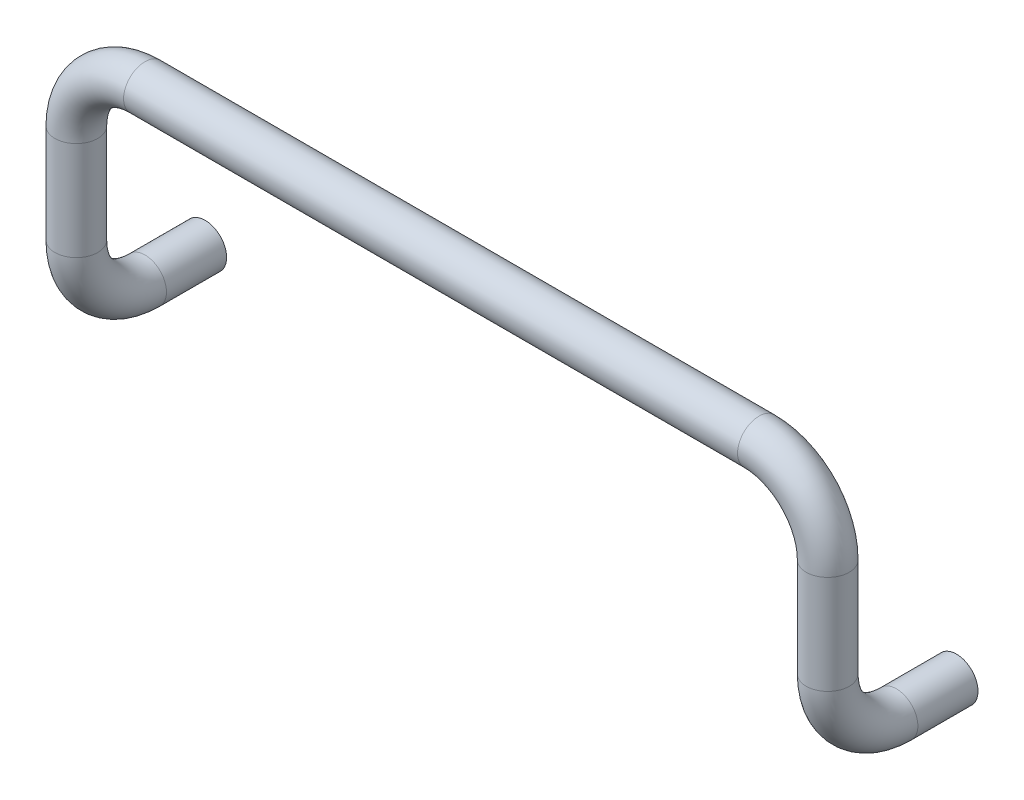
ISO-10303-21;
HEADER;
FILE_DESCRIPTION(('STEP AP214'),'2;1');
FILE_NAME('part.step','',(''),(''),'','','');
FILE_SCHEMA(('AUTOMOTIVE_DESIGN { 1 0 10303 214 1 1 1 1 }'));
ENDSEC;
DATA;
#1=APPLICATION_CONTEXT('core data for automotive mechanical design processes');
#2=APPLICATION_PROTOCOL_DEFINITION('international standard','automotive_design',2000,#1);
#3=PRODUCT_CONTEXT('',#1,'mechanical');
#4=PRODUCT('Part','Part','',(#3));
#5=PRODUCT_RELATED_PRODUCT_CATEGORY('part','',(#4));
#6=PRODUCT_DEFINITION_FORMATION('','',#4);
#7=PRODUCT_DEFINITION_CONTEXT('part definition',#1,'design');
#8=PRODUCT_DEFINITION('design','',#6,#7);
#9=PRODUCT_DEFINITION_SHAPE('','',#8);
#10=(LENGTH_UNIT() NAMED_UNIT(*) SI_UNIT(.MILLI.,.METRE.));
#11=(NAMED_UNIT(*) PLANE_ANGLE_UNIT() SI_UNIT($,.RADIAN.));
#12=(NAMED_UNIT(*) SI_UNIT($,.STERADIAN.) SOLID_ANGLE_UNIT());
#13=UNCERTAINTY_MEASURE_WITH_UNIT(LENGTH_MEASURE(1.E-05),#10,'distance_accuracy_value','');
#14=(GEOMETRIC_REPRESENTATION_CONTEXT(3) GLOBAL_UNCERTAINTY_ASSIGNED_CONTEXT((#13)) GLOBAL_UNIT_ASSIGNED_CONTEXT((#10,
#11,#12)) REPRESENTATION_CONTEXT('',''));
#15=CARTESIAN_POINT('',(0.,0.,0.));
#16=DIRECTION('',(0.,0.,1.));
#17=DIRECTION('',(1.,0.,0.));
#18=AXIS2_PLACEMENT_3D('',#15,#16,#17);
#19=CARTESIAN_POINT('',(0.,0.,28.));
#20=DIRECTION('',(0.,0.,-1.));
#21=DIRECTION('',(-1.,0.,0.));
#22=AXIS2_PLACEMENT_3D('',#19,#20,#21);
#23=CYLINDRICAL_SURFACE('',#22,10.);
#24=CARTESIAN_POINT('',(0.,0.,28.));
#25=DIRECTION('',(0.,0.,-1.));
#26=DIRECTION('',(-1.,0.,0.));
#27=AXIS2_PLACEMENT_3D('',#24,#25,#26);
#28=CIRCLE('',#27,10.);
#29=CARTESIAN_POINT('',(0.,-10.,28.));
#30=VERTEX_POINT('',#29);
#31=EDGE_CURVE('E35',#30,#30,#28,.T.);
#32=ORIENTED_EDGE('',*,*,#31,.T.);
#33=EDGE_LOOP('',(#32));
#34=FACE_BOUND('',#33,.T.);
#35=CARTESIAN_POINT('',(0.,0.,0.));
#36=DIRECTION('',(0.,0.,-1.));
#37=DIRECTION('',(-1.,0.,0.));
#38=AXIS2_PLACEMENT_3D('',#35,#36,#37);
#39=CIRCLE('',#38,10.);
#40=CARTESIAN_POINT('',(-10.,0.,0.));
#41=VERTEX_POINT('',#40);
#42=EDGE_CURVE('E32',#41,#41,#39,.T.);
#43=ORIENTED_EDGE('',*,*,#42,.F.);
#44=EDGE_LOOP('',(#43));
#45=FACE_BOUND('',#44,.T.);
#46=ADVANCED_FACE('F12',(#34,#45),#23,.T.);
#47=CARTESIAN_POINT('',(0.,32.,28.));
#48=DIRECTION('',(1.,0.,0.));
#49=DIRECTION('',(0.,1.,0.));
#50=AXIS2_PLACEMENT_3D('',#47,#48,#49);
#51=TOROIDAL_SURFACE('',#50,32.,10.);
#52=CARTESIAN_POINT('',(0.,32.,60.));
#53=DIRECTION('',(0.,-1.,0.));
#54=DIRECTION('',(-1.,0.,0.));
#55=AXIS2_PLACEMENT_3D('',#52,#53,#54);
#56=CIRCLE('',#55,10.);
#57=CARTESIAN_POINT('',(0.,32.,70.));
#58=VERTEX_POINT('',#57);
#59=EDGE_CURVE('E38',#58,#58,#56,.T.);
#60=CARTESIAN_POINT('',(0.,32.,28.));
#61=DIRECTION('',(1.,0.,0.));
#62=DIRECTION('',(0.,1.,0.));
#63=AXIS2_PLACEMENT_3D('',#60,#61,#62);
#64=CIRCLE('',#63,42.);
#65=EDGE_CURVE('',#58,#30,#64,.T.);
#66=ORIENTED_EDGE('',*,*,#59,.T.);
#67=ORIENTED_EDGE('',*,*,#31,.F.);
#68=ORIENTED_EDGE('',*,*,#65,.T.);
#69=ORIENTED_EDGE('',*,*,#65,.F.);
#70=EDGE_LOOP('',(#66,#68,#67,#69));
#71=FACE_BOUND('',#70,.T.);
#72=ADVANCED_FACE('F90',(#71),#51,.T.);
#73=CARTESIAN_POINT('',(0.,78.,60.));
#74=DIRECTION('',(0.,-1.,0.));
#75=DIRECTION('',(0.,0.,-1.));
#76=AXIS2_PLACEMENT_3D('',#73,#74,#75);
#77=CYLINDRICAL_SURFACE('',#76,10.);
#78=CARTESIAN_POINT('',(0.,78.,60.));
#79=DIRECTION('',(0.,-1.,0.));
#80=DIRECTION('',(-1.,0.,0.));
#81=AXIS2_PLACEMENT_3D('',#78,#79,#80);
#82=CIRCLE('',#81,10.);
#83=CARTESIAN_POINT('',(-10.,78.,60.));
#84=VERTEX_POINT('',#83);
#85=EDGE_CURVE('E41',#84,#84,#82,.T.);
#86=ORIENTED_EDGE('',*,*,#85,.T.);
#87=EDGE_LOOP('',(#86));
#88=FACE_BOUND('',#87,.T.);
#89=ORIENTED_EDGE('',*,*,#59,.F.);
#90=EDGE_LOOP('',(#89));
#91=FACE_BOUND('',#90,.T.);
#92=ADVANCED_FACE('F97',(#88,#91),#77,.T.);
#93=CARTESIAN_POINT('',(32.,78.,60.));
#94=DIRECTION('',(0.,0.,1.));
#95=DIRECTION('',(1.,0.,0.));
#96=AXIS2_PLACEMENT_3D('',#93,#94,#95);
#97=TOROIDAL_SURFACE('',#96,32.,10.);
#98=CARTESIAN_POINT('',(32.,110.,60.));
#99=DIRECTION('',(-1.,0.,0.));
#100=DIRECTION('',(0.,1.,0.));
#101=AXIS2_PLACEMENT_3D('',#98,#99,#100);
#102=CIRCLE('',#101,10.);
#103=CARTESIAN_POINT('',(32.,120.,60.));
#104=VERTEX_POINT('',#103);
#105=EDGE_CURVE('E44',#104,#104,#102,.T.);
#106=CARTESIAN_POINT('',(32.,78.,60.));
#107=DIRECTION('',(0.,0.,1.));
#108=DIRECTION('',(1.,0.,0.));
#109=AXIS2_PLACEMENT_3D('',#106,#107,#108);
#110=CIRCLE('',#109,42.);
#111=EDGE_CURVE('',#104,#84,#110,.T.);
#112=ORIENTED_EDGE('',*,*,#105,.T.);
#113=ORIENTED_EDGE('',*,*,#85,.F.);
#114=ORIENTED_EDGE('',*,*,#111,.T.);
#115=ORIENTED_EDGE('',*,*,#111,.F.);
#116=EDGE_LOOP('',(#112,#114,#113,#115));
#117=FACE_BOUND('',#116,.T.);
#118=ADVANCED_FACE('F104',(#117),#97,.T.);
#119=CARTESIAN_POINT('',(318.,110.,60.));
#120=DIRECTION('',(-1.,0.,0.));
#121=DIRECTION('',(0.,0.,1.));
#122=AXIS2_PLACEMENT_3D('',#119,#120,#121);
#123=CYLINDRICAL_SURFACE('',#122,10.);
#124=CARTESIAN_POINT('',(318.,110.,60.));
#125=DIRECTION('',(-1.,0.,0.));
#126=DIRECTION('',(0.,1.,0.));
#127=AXIS2_PLACEMENT_3D('',#124,#125,#126);
#128=CIRCLE('',#127,10.);
#129=CARTESIAN_POINT('',(318.,120.,60.));
#130=VERTEX_POINT('',#129);
#131=EDGE_CURVE('E47',#130,#130,#128,.T.);
#132=ORIENTED_EDGE('',*,*,#131,.T.);
#133=EDGE_LOOP('',(#132));
#134=FACE_BOUND('',#133,.T.);
#135=ORIENTED_EDGE('',*,*,#105,.F.);
#136=EDGE_LOOP('',(#135));
#137=FACE_BOUND('',#136,.T.);
#138=ADVANCED_FACE('F108',(#134,#137),#123,.T.);
#139=CARTESIAN_POINT('',(318.,78.,60.));
#140=DIRECTION('',(0.,0.,1.));
#141=DIRECTION('',(1.,0.,0.));
#142=AXIS2_PLACEMENT_3D('',#139,#140,#141);
#143=TOROIDAL_SURFACE('',#142,32.,10.);
#144=CARTESIAN_POINT('',(350.,78.,60.));
#145=DIRECTION('',(0.,1.,0.));
#146=DIRECTION('',(1.,0.,0.));
#147=AXIS2_PLACEMENT_3D('',#144,#145,#146);
#148=CIRCLE('',#147,10.);
#149=CARTESIAN_POINT('',(360.,78.,60.));
#150=VERTEX_POINT('',#149);
#151=EDGE_CURVE('E50',#150,#150,#148,.T.);
#152=CARTESIAN_POINT('',(318.,78.,60.));
#153=DIRECTION('',(0.,0.,1.));
#154=DIRECTION('',(1.,0.,0.));
#155=AXIS2_PLACEMENT_3D('',#152,#153,#154);
#156=CIRCLE('',#155,42.);
#157=EDGE_CURVE('',#150,#130,#156,.T.);
#158=ORIENTED_EDGE('',*,*,#151,.T.);
#159=ORIENTED_EDGE('',*,*,#131,.F.);
#160=ORIENTED_EDGE('',*,*,#157,.T.);
#161=ORIENTED_EDGE('',*,*,#157,.F.);
#162=EDGE_LOOP('',(#158,#160,#159,#161));
#163=FACE_BOUND('',#162,.T.);
#164=ADVANCED_FACE('F112',(#163),#143,.T.);
#165=CARTESIAN_POINT('',(350.,32.,60.));
#166=DIRECTION('',(0.,1.,0.));
#167=DIRECTION('',(0.,0.,1.));
#168=AXIS2_PLACEMENT_3D('',#165,#166,#167);
#169=CYLINDRICAL_SURFACE('',#168,10.);
#170=CARTESIAN_POINT('',(350.,32.,60.));
#171=DIRECTION('',(0.,1.,0.));
#172=DIRECTION('',(1.,0.,0.));
#173=AXIS2_PLACEMENT_3D('',#170,#171,#172);
#174=CIRCLE('',#173,10.);
#175=CARTESIAN_POINT('',(350.,32.,70.));
#176=VERTEX_POINT('',#175);
#177=EDGE_CURVE('E53',#176,#176,#174,.T.);
#178=ORIENTED_EDGE('',*,*,#177,.T.);
#179=EDGE_LOOP('',(#178));
#180=FACE_BOUND('',#179,.T.);
#181=ORIENTED_EDGE('',*,*,#151,.F.);
#182=EDGE_LOOP('',(#181));
#183=FACE_BOUND('',#182,.T.);
#184=ADVANCED_FACE('F116',(#180,#183),#169,.T.);
#185=CARTESIAN_POINT('',(350.,32.,28.));
#186=DIRECTION('',(-1.,0.,0.));
#187=DIRECTION('',(0.,-1.,0.));
#188=AXIS2_PLACEMENT_3D('',#185,#186,#187);
#189=TOROIDAL_SURFACE('',#188,32.,10.);
#190=CARTESIAN_POINT('',(350.,0.,28.));
#191=DIRECTION('',(0.,0.,1.));
#192=DIRECTION('',(1.,0.,0.));
#193=AXIS2_PLACEMENT_3D('',#190,#191,#192);
#194=CIRCLE('',#193,10.);
#195=CARTESIAN_POINT('',(350.,-10.,28.));
#196=VERTEX_POINT('',#195);
#197=EDGE_CURVE('E56',#196,#196,#194,.T.);
#198=CARTESIAN_POINT('',(350.,32.,28.));
#199=DIRECTION('',(-1.,0.,0.));
#200=DIRECTION('',(0.,-1.,0.));
#201=AXIS2_PLACEMENT_3D('',#198,#199,#200);
#202=CIRCLE('',#201,42.);
#203=EDGE_CURVE('',#196,#176,#202,.T.);
#204=ORIENTED_EDGE('',*,*,#197,.T.);
#205=ORIENTED_EDGE('',*,*,#177,.F.);
#206=ORIENTED_EDGE('',*,*,#203,.T.);
#207=ORIENTED_EDGE('',*,*,#203,.F.);
#208=EDGE_LOOP('',(#204,#206,#205,#207));
#209=FACE_BOUND('',#208,.T.);
#210=ADVANCED_FACE('F120',(#209),#189,.T.);
#211=CARTESIAN_POINT('',(350.,0.,28.));
#212=DIRECTION('',(0.,0.,-1.));
#213=DIRECTION('',(-1.,0.,0.));
#214=AXIS2_PLACEMENT_3D('',#211,#212,#213);
#215=CYLINDRICAL_SURFACE('',#214,10.);
#216=ORIENTED_EDGE('',*,*,#197,.F.);
#217=EDGE_LOOP('',(#216));
#218=FACE_BOUND('',#217,.T.);
#219=CARTESIAN_POINT('',(350.,0.,0.));
#220=DIRECTION('',(0.,0.,1.));
#221=DIRECTION('',(1.,0.,0.));
#222=AXIS2_PLACEMENT_3D('',#219,#220,#221);
#223=CIRCLE('',#222,10.);
#224=CARTESIAN_POINT('',(360.,0.,0.));
#225=VERTEX_POINT('',#224);
#226=EDGE_CURVE('E59',#225,#225,#223,.T.);
#227=ORIENTED_EDGE('',*,*,#226,.T.);
#228=EDGE_LOOP('',(#227));
#229=FACE_BOUND('',#228,.T.);
#230=ADVANCED_FACE('F124',(#218,#229),#215,.T.);
#231=CARTESIAN_POINT('',(0.,0.,0.));
#232=DIRECTION('',(0.,0.,-1.));
#233=DIRECTION('',(-1.,0.,0.));
#234=AXIS2_PLACEMENT_3D('',#231,#232,#233);
#235=PLANE('',#234);
#236=CARTESIAN_POINT('',(0.,0.,0.));
#237=DIRECTION('',(0.,0.,-1.));
#238=DIRECTION('',(-1.,0.,0.));
#239=AXIS2_PLACEMENT_3D('',#236,#237,#238);
#240=CIRCLE('',#239,4.49999999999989);
#241=CARTESIAN_POINT('',(-4.49999999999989,0.,0.));
#242=VERTEX_POINT('',#241);
#243=EDGE_CURVE('E23',#242,#242,#240,.F.);
#244=ORIENTED_EDGE('',*,*,#243,.T.);
#245=EDGE_LOOP('',(#244));
#246=FACE_BOUND('',#245,.T.);
#247=ORIENTED_EDGE('',*,*,#42,.T.);
#248=EDGE_LOOP('',(#247));
#249=FACE_BOUND('',#248,.T.);
#250=ADVANCED_FACE('F126',(#246,#249),#235,.T.);
#251=CARTESIAN_POINT('',(350.,0.,0.));
#252=DIRECTION('',(0.,0.,1.));
#253=DIRECTION('',(1.,0.,0.));
#254=AXIS2_PLACEMENT_3D('',#251,#252,#253);
#255=PLANE('',#254);
#256=CARTESIAN_POINT('',(350.,0.,0.));
#257=DIRECTION('',(0.,0.,1.));
#258=DIRECTION('',(1.,0.,0.));
#259=AXIS2_PLACEMENT_3D('',#256,#257,#258);
#260=CIRCLE('',#259,4.49999999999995);
#261=CARTESIAN_POINT('',(354.5,0.,0.));
#262=VERTEX_POINT('',#261);
#263=EDGE_CURVE('E8',#262,#262,#260,.T.);
#264=ORIENTED_EDGE('',*,*,#263,.T.);
#265=EDGE_LOOP('',(#264));
#266=FACE_BOUND('',#265,.T.);
#267=ORIENTED_EDGE('',*,*,#226,.F.);
#268=EDGE_LOOP('',(#267));
#269=FACE_BOUND('',#268,.T.);
#270=ADVANCED_FACE('F86',(#266,#269),#255,.F.);
#271=CARTESIAN_POINT('',(0.,0.,15.));
#272=DIRECTION('',(0.,0.,-1.));
#273=DIRECTION('',(-1.,0.,0.));
#274=AXIS2_PLACEMENT_3D('',#271,#272,#273);
#275=CYLINDRICAL_SURFACE('',#274,4.);
#276=CARTESIAN_POINT('',(0.,0.,0.499999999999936));
#277=DIRECTION('',(0.,0.,-1.));
#278=DIRECTION('',(-1.,0.,0.));
#279=AXIS2_PLACEMENT_3D('',#276,#277,#278);
#280=CIRCLE('',#279,4.);
#281=CARTESIAN_POINT('',(-4.,0.,0.499999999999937));
#282=VERTEX_POINT('',#281);
#283=EDGE_CURVE('E27',#282,#282,#280,.T.);
#284=ORIENTED_EDGE('',*,*,#283,.T.);
#285=EDGE_LOOP('',(#284));
#286=FACE_BOUND('',#285,.T.);
#287=CARTESIAN_POINT('',(0.,0.,15.));
#288=DIRECTION('',(0.,0.,-1.));
#289=DIRECTION('',(-1.,0.,0.));
#290=AXIS2_PLACEMENT_3D('',#287,#288,#289);
#291=CIRCLE('',#290,4.);
#292=CARTESIAN_POINT('',(-4.,0.,15.));
#293=VERTEX_POINT('',#292);
#294=EDGE_CURVE('E62',#293,#293,#291,.T.);
#295=ORIENTED_EDGE('',*,*,#294,.F.);
#296=EDGE_LOOP('',(#295));
#297=FACE_BOUND('',#296,.T.);
#298=ADVANCED_FACE('F83',(#286,#297),#275,.F.);
#299=CARTESIAN_POINT('',(0.,0.,15.));
#300=DIRECTION('',(0.,0.,-1.));
#301=DIRECTION('',(-1.,0.,0.));
#302=AXIS2_PLACEMENT_3D('',#299,#300,#301);
#303=PLANE('',#302);
#304=ORIENTED_EDGE('',*,*,#294,.T.);
#305=EDGE_LOOP('',(#304));
#306=FACE_BOUND('',#305,.T.);
#307=ADVANCED_FACE('F73',(#306),#303,.T.);
#308=CARTESIAN_POINT('',(350.,0.,15.));
#309=DIRECTION('',(0.,0.,-1.));
#310=DIRECTION('',(-1.,0.,0.));
#311=AXIS2_PLACEMENT_3D('',#308,#309,#310);
#312=CYLINDRICAL_SURFACE('',#311,4.);
#313=CARTESIAN_POINT('',(350.,0.,0.499999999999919));
#314=DIRECTION('',(0.,0.,1.));
#315=DIRECTION('',(1.,0.,0.));
#316=AXIS2_PLACEMENT_3D('',#313,#314,#315);
#317=CIRCLE('',#316,4.);
#318=CARTESIAN_POINT('',(354.,0.,0.499999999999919));
#319=VERTEX_POINT('',#318);
#320=EDGE_CURVE('E19',#319,#319,#317,.F.);
#321=ORIENTED_EDGE('',*,*,#320,.T.);
#322=EDGE_LOOP('',(#321));
#323=FACE_BOUND('',#322,.T.);
#324=CARTESIAN_POINT('',(350.,0.,15.));
#325=DIRECTION('',(0.,0.,-1.));
#326=DIRECTION('',(-1.,0.,0.));
#327=AXIS2_PLACEMENT_3D('',#324,#325,#326);
#328=CIRCLE('',#327,4.);
#329=CARTESIAN_POINT('',(346.,0.,15.));
#330=VERTEX_POINT('',#329);
#331=EDGE_CURVE('E65',#330,#330,#328,.T.);
#332=ORIENTED_EDGE('',*,*,#331,.F.);
#333=EDGE_LOOP('',(#332));
#334=FACE_BOUND('',#333,.T.);
#335=ADVANCED_FACE('F71',(#323,#334),#312,.F.);
#336=CARTESIAN_POINT('',(350.,0.,15.));
#337=DIRECTION('',(0.,0.,-1.));
#338=DIRECTION('',(-1.,0.,0.));
#339=AXIS2_PLACEMENT_3D('',#336,#337,#338);
#340=PLANE('',#339);
#341=ORIENTED_EDGE('',*,*,#331,.T.);
#342=EDGE_LOOP('',(#341));
#343=FACE_BOUND('',#342,.T.);
#344=ADVANCED_FACE('F69',(#343),#340,.T.);
#345=CARTESIAN_POINT('',(0.,0.,0.499999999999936));
#346=DIRECTION('',(0.,0.,-1.));
#347=DIRECTION('',(-1.,0.,0.));
#348=AXIS2_PLACEMENT_3D('',#345,#346,#347);
#349=CONICAL_SURFACE('',#348,4.,0.785398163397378);
#350=ORIENTED_EDGE('',*,*,#243,.F.);
#351=EDGE_LOOP('',(#350));
#352=FACE_BOUND('',#351,.T.);
#353=ORIENTED_EDGE('',*,*,#283,.F.);
#354=EDGE_LOOP('',(#353));
#355=FACE_BOUND('',#354,.T.);
#356=ADVANCED_FACE('F75',(#352,#355),#349,.F.);
#357=CARTESIAN_POINT('',(350.,0.,0.499999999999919));
#358=DIRECTION('',(0.,0.,-1.));
#359=DIRECTION('',(-1.,0.,0.));
#360=AXIS2_PLACEMENT_3D('',#357,#358,#359);
#361=CONICAL_SURFACE('',#360,4.,0.785398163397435);
#362=ORIENTED_EDGE('',*,*,#263,.F.);
#363=EDGE_LOOP('',(#362));
#364=FACE_BOUND('',#363,.T.);
#365=ORIENTED_EDGE('',*,*,#320,.F.);
#366=EDGE_LOOP('',(#365));
#367=FACE_BOUND('',#366,.T.);
#368=ADVANCED_FACE('F14',(#364,#367),#361,.F.);
#369=CLOSED_SHELL('',(#46,#72,#92,#118,#138,#164,#184,#210,#230,#250,#270,#298,#307,#335,#344,
#356,#368));
#370=MANIFOLD_SOLID_BREP('B1',#369);
#371=ADVANCED_BREP_SHAPE_REPRESENTATION('',(#18,#370),#14);
#372=SHAPE_DEFINITION_REPRESENTATION(#9,#371);
ENDSEC;
END-ISO-10303-21;
